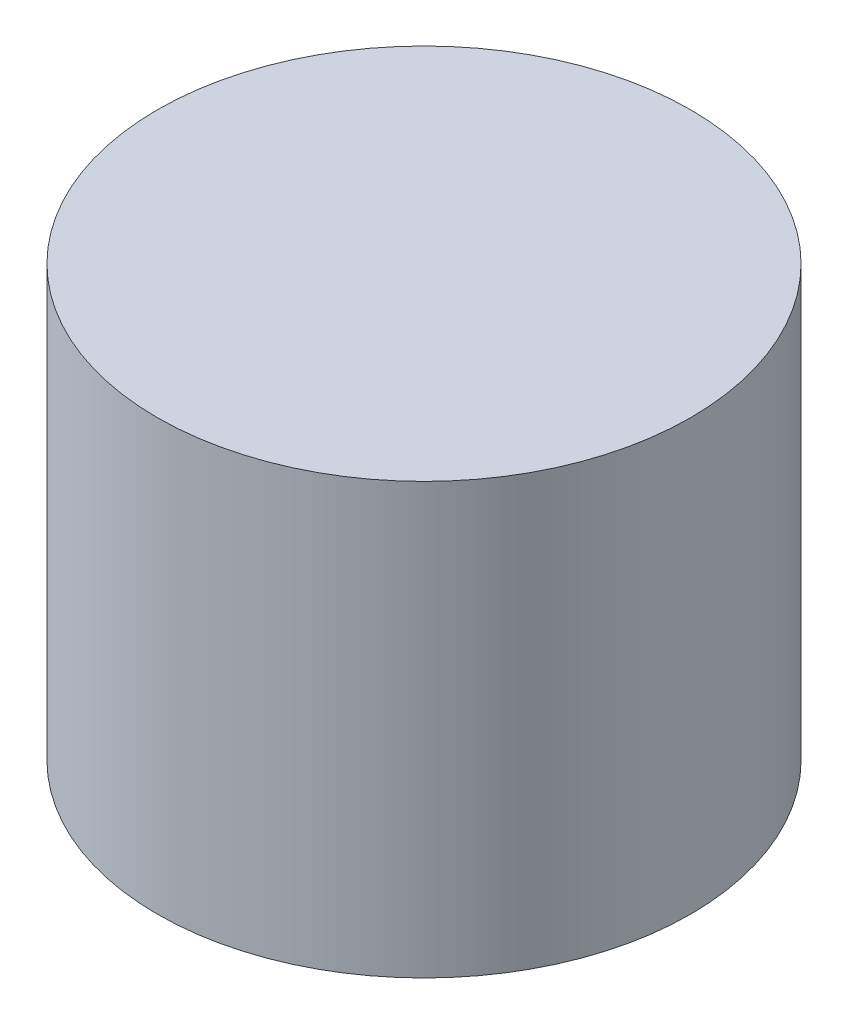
from build123d import *

# Parameters (mm, degrees)
SKETCH1_R      = 31.496
EXTRUDE1_DEPTH = 50.8


with BuildPart() as part:
    # Sketch1 → Extrude1 (new body)
    with BuildSketch(Plane(origin=(0, 0, 0), x_dir=(1, 0, 0), z_dir=(0, 1, 0))):
        with Locations(Location((0, 0, 0), (0, 0, 270))):
            Circle(SKETCH1_R)
    extrude(amount=EXTRUDE1_DEPTH)


solid = part.part
